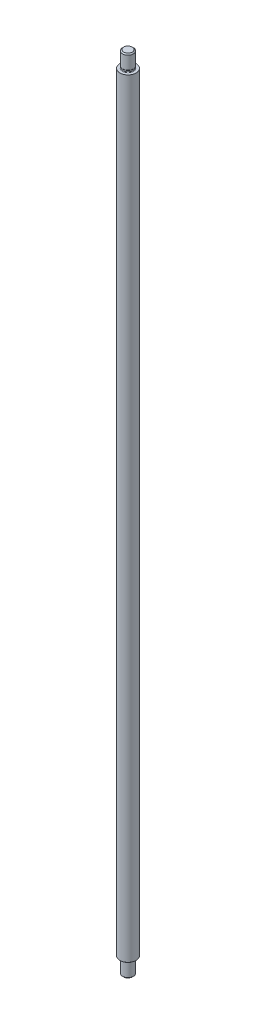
ISO-10303-21;
HEADER;
FILE_DESCRIPTION(('STEP AP214'),'2;1');
FILE_NAME('part.step','',(''),(''),'','','');
FILE_SCHEMA(('AUTOMOTIVE_DESIGN { 1 0 10303 214 1 1 1 1 }'));
ENDSEC;
DATA;
#1=APPLICATION_CONTEXT('core data for automotive mechanical design processes');
#2=APPLICATION_PROTOCOL_DEFINITION('international standard','automotive_design',2000,#1);
#3=PRODUCT_CONTEXT('',#1,'mechanical');
#4=PRODUCT('Part','Part','',(#3));
#5=PRODUCT_RELATED_PRODUCT_CATEGORY('part','',(#4));
#6=PRODUCT_DEFINITION_FORMATION('','',#4);
#7=PRODUCT_DEFINITION_CONTEXT('part definition',#1,'design');
#8=PRODUCT_DEFINITION('design','',#6,#7);
#9=PRODUCT_DEFINITION_SHAPE('','',#8);
#10=(LENGTH_UNIT() NAMED_UNIT(*) SI_UNIT(.MILLI.,.METRE.));
#11=(NAMED_UNIT(*) PLANE_ANGLE_UNIT() SI_UNIT($,.RADIAN.));
#12=(NAMED_UNIT(*) SI_UNIT($,.STERADIAN.) SOLID_ANGLE_UNIT());
#13=UNCERTAINTY_MEASURE_WITH_UNIT(LENGTH_MEASURE(1.E-05),#10,'distance_accuracy_value','');
#14=(GEOMETRIC_REPRESENTATION_CONTEXT(3) GLOBAL_UNCERTAINTY_ASSIGNED_CONTEXT((#13)) GLOBAL_UNIT_ASSIGNED_CONTEXT((#10,
#11,#12)) REPRESENTATION_CONTEXT('',''));
#15=CARTESIAN_POINT('',(0.,0.,0.));
#16=DIRECTION('',(0.,0.,1.));
#17=DIRECTION('',(1.,0.,0.));
#18=AXIS2_PLACEMENT_3D('',#15,#16,#17);
#19=CARTESIAN_POINT('',(-6.41454642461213E-11,-139.,0.));
#20=DIRECTION('',(0.,1.,0.));
#21=DIRECTION('',(0.,0.,1.));
#22=AXIS2_PLACEMENT_3D('',#19,#20,#21);
#23=CONICAL_SURFACE('',#22,5.00000000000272,0.785398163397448);
#24=CARTESIAN_POINT('',(-6.41454642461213E-11,-140.00000000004,0.));
#25=DIRECTION('',(0.,1.,0.));
#26=DIRECTION('',(0.,0.,1.));
#27=AXIS2_PLACEMENT_3D('',#24,#25,#26);
#28=CIRCLE('',#27,3.99999999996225);
#29=CARTESIAN_POINT('',(-6.41454642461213E-11,-140.00000000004,3.99999999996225));
#30=VERTEX_POINT('',#29);
#31=EDGE_CURVE('E83',#30,#30,#28,.T.);
#32=ORIENTED_EDGE('',*,*,#31,.T.);
#33=EDGE_LOOP('',(#32));
#34=FACE_BOUND('',#33,.T.);
#35=CARTESIAN_POINT('',(-6.41454642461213E-11,-139.,0.));
#36=DIRECTION('',(0.,1.,0.));
#37=DIRECTION('',(0.,0.,1.));
#38=AXIS2_PLACEMENT_3D('',#35,#36,#37);
#39=CIRCLE('',#38,5.00000000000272);
#40=CARTESIAN_POINT('',(-6.41454642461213E-11,-139.,5.00000000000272));
#41=VERTEX_POINT('',#40);
#42=EDGE_CURVE('E10',#41,#41,#39,.T.);
#43=ORIENTED_EDGE('',*,*,#42,.F.);
#44=EDGE_LOOP('',(#43));
#45=FACE_BOUND('',#44,.T.);
#46=ADVANCED_FACE('F31',(#34,#45),#23,.T.);
#47=CARTESIAN_POINT('',(-6.41454642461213E-11,-140.00000000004,0.));
#48=DIRECTION('',(0.,1.,0.));
#49=DIRECTION('',(0.,0.,1.));
#50=AXIS2_PLACEMENT_3D('',#47,#48,#49);
#51=CYLINDRICAL_SURFACE('',#50,5.00000000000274);
#52=ORIENTED_EDGE('',*,*,#42,.T.);
#53=EDGE_LOOP('',(#52));
#54=FACE_BOUND('',#53,.T.);
#55=CARTESIAN_POINT('',(-6.41454642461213E-11,-126.999999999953,0.));
#56=DIRECTION('',(0.,1.,0.));
#57=DIRECTION('',(0.,0.,1.));
#58=AXIS2_PLACEMENT_3D('',#55,#56,#57);
#59=CIRCLE('',#58,5.00000000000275);
#60=CARTESIAN_POINT('',(-6.41454642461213E-11,-126.999999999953,5.00000000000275));
#61=VERTEX_POINT('',#60);
#62=EDGE_CURVE('E37',#61,#61,#59,.T.);
#63=ORIENTED_EDGE('',*,*,#62,.F.);
#64=EDGE_LOOP('',(#63));
#65=FACE_BOUND('',#64,.T.);
#66=ADVANCED_FACE('F100',(#54,#65),#51,.T.);
#67=CARTESIAN_POINT('',(-6.41454642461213E-11,-126.687867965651,0.));
#68=DIRECTION('',(0.,-1.,0.));
#69=DIRECTION('',(0.,0.,-1.));
#70=AXIS2_PLACEMENT_3D('',#67,#68,#69);
#71=CONICAL_SURFACE('',#70,4.68786796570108,0.785398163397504);
#72=ORIENTED_EDGE('',*,*,#62,.T.);
#73=EDGE_LOOP('',(#72));
#74=FACE_BOUND('',#73,.T.);
#75=CARTESIAN_POINT('',(-6.41454642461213E-11,-126.687867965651,0.));
#76=DIRECTION('',(0.,1.,0.));
#77=DIRECTION('',(0.,0.,1.));
#78=AXIS2_PLACEMENT_3D('',#75,#76,#77);
#79=CIRCLE('',#78,4.68786796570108);
#80=CARTESIAN_POINT('',(-6.41454642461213E-11,-126.687867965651,4.68786796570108));
#81=VERTEX_POINT('',#80);
#82=EDGE_CURVE('E41',#81,#81,#79,.T.);
#83=ORIENTED_EDGE('',*,*,#82,.F.);
#84=EDGE_LOOP('',(#83));
#85=FACE_BOUND('',#84,.T.);
#86=ADVANCED_FACE('F104',(#74,#85),#71,.T.);
#87=CARTESIAN_POINT('',(-6.41457373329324E-11,-126.475735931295,0.));
#88=DIRECTION('',(0.,1.,0.));
#89=DIRECTION('',(0.,0.,1.));
#90=AXIS2_PLACEMENT_3D('',#87,#88,#89);
#91=TOROIDAL_SURFACE('',#90,4.90000000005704,0.300000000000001);
#92=ORIENTED_EDGE('',*,*,#82,.T.);
#93=EDGE_LOOP('',(#92));
#94=FACE_BOUND('',#93,.T.);
#95=CARTESIAN_POINT('',(-6.41454642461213E-11,-126.475735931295,0.));
#96=DIRECTION('',(0.,1.,0.));
#97=DIRECTION('',(0.,0.,1.));
#98=AXIS2_PLACEMENT_3D('',#95,#96,#97);
#99=CIRCLE('',#98,4.60000000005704);
#100=CARTESIAN_POINT('',(-6.41454642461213E-11,-126.475735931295,4.60000000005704));
#101=VERTEX_POINT('',#100);
#102=EDGE_CURVE('E45',#101,#101,#99,.T.);
#103=ORIENTED_EDGE('',*,*,#102,.F.);
#104=EDGE_LOOP('',(#103));
#105=FACE_BOUND('',#104,.T.);
#106=ADVANCED_FACE('F108',(#94,#105),#91,.F.);
#107=CARTESIAN_POINT('',(-6.41454642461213E-11,-140.00000000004,0.));
#108=DIRECTION('',(0.,1.,0.));
#109=DIRECTION('',(0.,0.,1.));
#110=AXIS2_PLACEMENT_3D('',#107,#108,#109);
#111=CYLINDRICAL_SURFACE('',#110,4.60000000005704);
#112=ORIENTED_EDGE('',*,*,#102,.T.);
#113=EDGE_LOOP('',(#112));
#114=FACE_BOUND('',#113,.T.);
#115=CARTESIAN_POINT('',(-6.41454642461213E-11,-125.500000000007,0.));
#116=DIRECTION('',(0.,1.,0.));
#117=DIRECTION('',(0.,0.,1.));
#118=AXIS2_PLACEMENT_3D('',#115,#116,#117);
#119=CIRCLE('',#118,4.60000000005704);
#120=CARTESIAN_POINT('',(-6.41454642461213E-11,-125.500000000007,4.60000000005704));
#121=VERTEX_POINT('',#120);
#122=EDGE_CURVE('E50',#121,#121,#119,.T.);
#123=ORIENTED_EDGE('',*,*,#122,.F.);
#124=EDGE_LOOP('',(#123));
#125=FACE_BOUND('',#124,.T.);
#126=ADVANCED_FACE('F114',(#114,#125),#111,.T.);
#127=CARTESIAN_POINT('',(-6.41457373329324E-11,-125.500000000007,0.));
#128=DIRECTION('',(0.,1.,0.));
#129=DIRECTION('',(0.,0.,1.));
#130=AXIS2_PLACEMENT_3D('',#127,#128,#129);
#131=TOROIDAL_SURFACE('',#130,5.10000000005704,0.500000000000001);
#132=ORIENTED_EDGE('',*,*,#122,.T.);
#133=EDGE_LOOP('',(#132));
#134=FACE_BOUND('',#133,.T.);
#135=CARTESIAN_POINT('',(-6.41454642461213E-11,-125.000000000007,0.));
#136=DIRECTION('',(0.,1.,0.));
#137=DIRECTION('',(0.,0.,1.));
#138=AXIS2_PLACEMENT_3D('',#135,#136,#137);
#139=CIRCLE('',#138,5.10000000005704);
#140=CARTESIAN_POINT('',(-6.41454642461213E-11,-125.000000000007,5.10000000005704));
#141=VERTEX_POINT('',#140);
#142=EDGE_CURVE('E53',#141,#141,#139,.T.);
#143=ORIENTED_EDGE('',*,*,#142,.F.);
#144=EDGE_LOOP('',(#143));
#145=FACE_BOUND('',#144,.T.);
#146=ADVANCED_FACE('F118',(#134,#145),#131,.F.);
#147=CARTESIAN_POINT('',(7.4999999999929,-125.000000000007,0.));
#148=DIRECTION('',(0.,-1.,0.));
#149=DIRECTION('',(0.,0.,-1.));
#150=AXIS2_PLACEMENT_3D('',#147,#148,#149);
#151=PLANE('',#150);
#152=ORIENTED_EDGE('',*,*,#142,.T.);
#153=EDGE_LOOP('',(#152));
#154=FACE_BOUND('',#153,.T.);
#155=CARTESIAN_POINT('',(-6.41454642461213E-11,-125.000000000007,0.));
#156=DIRECTION('',(0.,1.,0.));
#157=DIRECTION('',(0.,0.,1.));
#158=AXIS2_PLACEMENT_3D('',#155,#156,#157);
#159=CIRCLE('',#158,7.50000000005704);
#160=CARTESIAN_POINT('',(-6.41454642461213E-11,-125.000000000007,7.50000000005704));
#161=VERTEX_POINT('',#160);
#162=EDGE_CURVE('E56',#161,#161,#159,.T.);
#163=ORIENTED_EDGE('',*,*,#162,.F.);
#164=EDGE_LOOP('',(#163));
#165=FACE_BOUND('',#164,.T.);
#166=ADVANCED_FACE('F122',(#154,#165),#151,.T.);
#167=CARTESIAN_POINT('',(-6.41454642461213E-11,-140.00000000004,0.));
#168=DIRECTION('',(0.,1.,0.));
#169=DIRECTION('',(0.,0.,1.));
#170=AXIS2_PLACEMENT_3D('',#167,#168,#169);
#171=CYLINDRICAL_SURFACE('',#170,7.50000000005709);
#172=ORIENTED_EDGE('',*,*,#162,.T.);
#173=EDGE_LOOP('',(#172));
#174=FACE_BOUND('',#173,.T.);
#175=CARTESIAN_POINT('',(-6.41454642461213E-11,584.999999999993,0.));
#176=DIRECTION('',(0.,1.,0.));
#177=DIRECTION('',(0.,0.,1.));
#178=AXIS2_PLACEMENT_3D('',#175,#176,#177);
#179=CIRCLE('',#178,7.50000000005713);
#180=CARTESIAN_POINT('',(-6.41454642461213E-11,584.999999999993,7.50000000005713));
#181=VERTEX_POINT('',#180);
#182=EDGE_CURVE('E59',#181,#181,#179,.T.);
#183=ORIENTED_EDGE('',*,*,#182,.F.);
#184=EDGE_LOOP('',(#183));
#185=FACE_BOUND('',#184,.T.);
#186=ADVANCED_FACE('F126',(#174,#185),#171,.T.);
#187=CARTESIAN_POINT('',(5.09999999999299,584.999999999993,0.));
#188=DIRECTION('',(0.,1.,0.));
#189=DIRECTION('',(0.,0.,1.));
#190=AXIS2_PLACEMENT_3D('',#187,#188,#189);
#191=PLANE('',#190);
#192=ORIENTED_EDGE('',*,*,#182,.T.);
#193=EDGE_LOOP('',(#192));
#194=FACE_BOUND('',#193,.T.);
#195=CARTESIAN_POINT('',(-6.41454642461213E-11,584.999999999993,0.));
#196=DIRECTION('',(0.,1.,0.));
#197=DIRECTION('',(0.,0.,1.));
#198=AXIS2_PLACEMENT_3D('',#195,#196,#197);
#199=CIRCLE('',#198,5.10000000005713);
#200=CARTESIAN_POINT('',(-6.41454642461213E-11,584.999999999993,5.10000000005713));
#201=VERTEX_POINT('',#200);
#202=EDGE_CURVE('E62',#201,#201,#199,.T.);
#203=ORIENTED_EDGE('',*,*,#202,.F.);
#204=EDGE_LOOP('',(#203));
#205=FACE_BOUND('',#204,.T.);
#206=ADVANCED_FACE('F130',(#194,#205),#191,.T.);
#207=CARTESIAN_POINT('',(-6.41457373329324E-11,585.499999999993,0.));
#208=DIRECTION('',(0.,1.,0.));
#209=DIRECTION('',(0.,0.,1.));
#210=AXIS2_PLACEMENT_3D('',#207,#208,#209);
#211=TOROIDAL_SURFACE('',#210,5.10000000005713,0.500000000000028);
#212=ORIENTED_EDGE('',*,*,#202,.T.);
#213=EDGE_LOOP('',(#212));
#214=FACE_BOUND('',#213,.T.);
#215=CARTESIAN_POINT('',(-6.41454642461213E-11,585.499999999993,0.));
#216=DIRECTION('',(0.,1.,0.));
#217=DIRECTION('',(0.,0.,1.));
#218=AXIS2_PLACEMENT_3D('',#215,#216,#217);
#219=CIRCLE('',#218,4.60000000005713);
#220=CARTESIAN_POINT('',(-6.41454642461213E-11,585.499999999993,4.60000000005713));
#221=VERTEX_POINT('',#220);
#222=EDGE_CURVE('E65',#221,#221,#219,.T.);
#223=ORIENTED_EDGE('',*,*,#222,.F.);
#224=EDGE_LOOP('',(#223));
#225=FACE_BOUND('',#224,.T.);
#226=ADVANCED_FACE('F134',(#214,#225),#211,.F.);
#227=CARTESIAN_POINT('',(-6.41454642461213E-11,-140.00000000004,0.));
#228=DIRECTION('',(0.,1.,0.));
#229=DIRECTION('',(0.,0.,1.));
#230=AXIS2_PLACEMENT_3D('',#227,#228,#229);
#231=CYLINDRICAL_SURFACE('',#230,4.60000000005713);
#232=ORIENTED_EDGE('',*,*,#222,.T.);
#233=EDGE_LOOP('',(#232));
#234=FACE_BOUND('',#233,.T.);
#235=CARTESIAN_POINT('',(-6.41454642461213E-11,586.475735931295,0.));
#236=DIRECTION('',(0.,1.,0.));
#237=DIRECTION('',(0.,0.,1.));
#238=AXIS2_PLACEMENT_3D('',#235,#236,#237);
#239=CIRCLE('',#238,4.60000000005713);
#240=CARTESIAN_POINT('',(-6.41454642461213E-11,586.475735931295,4.60000000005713));
#241=VERTEX_POINT('',#240);
#242=EDGE_CURVE('E68',#241,#241,#239,.T.);
#243=ORIENTED_EDGE('',*,*,#242,.F.);
#244=EDGE_LOOP('',(#243));
#245=FACE_BOUND('',#244,.T.);
#246=ADVANCED_FACE('F138',(#234,#245),#231,.T.);
#247=CARTESIAN_POINT('',(-6.41457373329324E-11,586.475735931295,0.));
#248=DIRECTION('',(0.,1.,0.));
#249=DIRECTION('',(0.,0.,1.));
#250=AXIS2_PLACEMENT_3D('',#247,#248,#249);
#251=TOROIDAL_SURFACE('',#250,4.90000000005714,0.300000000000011);
#252=ORIENTED_EDGE('',*,*,#242,.T.);
#253=EDGE_LOOP('',(#252));
#254=FACE_BOUND('',#253,.T.);
#255=CARTESIAN_POINT('',(-6.41454642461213E-11,586.687867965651,0.));
#256=DIRECTION('',(0.,1.,0.));
#257=DIRECTION('',(0.,0.,1.));
#258=AXIS2_PLACEMENT_3D('',#255,#256,#257);
#259=CIRCLE('',#258,4.68786796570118);
#260=CARTESIAN_POINT('',(-6.41454642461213E-11,586.687867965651,4.68786796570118));
#261=VERTEX_POINT('',#260);
#262=EDGE_CURVE('E71',#261,#261,#259,.T.);
#263=ORIENTED_EDGE('',*,*,#262,.F.);
#264=EDGE_LOOP('',(#263));
#265=FACE_BOUND('',#264,.T.);
#266=ADVANCED_FACE('F142',(#254,#265),#251,.F.);
#267=CARTESIAN_POINT('',(-6.41454642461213E-11,586.999999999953,0.));
#268=DIRECTION('',(0.,1.,0.));
#269=DIRECTION('',(0.,0.,1.));
#270=AXIS2_PLACEMENT_3D('',#267,#268,#269);
#271=CONICAL_SURFACE('',#270,5.0000000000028,0.785398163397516);
#272=ORIENTED_EDGE('',*,*,#262,.T.);
#273=EDGE_LOOP('',(#272));
#274=FACE_BOUND('',#273,.T.);
#275=CARTESIAN_POINT('',(-6.41454642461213E-11,586.999999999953,0.));
#276=DIRECTION('',(0.,1.,0.));
#277=DIRECTION('',(0.,0.,1.));
#278=AXIS2_PLACEMENT_3D('',#275,#276,#277);
#279=CIRCLE('',#278,5.0000000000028);
#280=CARTESIAN_POINT('',(-6.41454642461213E-11,586.999999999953,5.0000000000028));
#281=VERTEX_POINT('',#280);
#282=EDGE_CURVE('E74',#281,#281,#279,.T.);
#283=ORIENTED_EDGE('',*,*,#282,.F.);
#284=EDGE_LOOP('',(#283));
#285=FACE_BOUND('',#284,.T.);
#286=ADVANCED_FACE('F146',(#274,#285),#271,.T.);
#287=CARTESIAN_POINT('',(-6.41454642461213E-11,-140.00000000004,0.));
#288=DIRECTION('',(0.,1.,0.));
#289=DIRECTION('',(0.,0.,1.));
#290=AXIS2_PLACEMENT_3D('',#287,#288,#289);
#291=CYLINDRICAL_SURFACE('',#290,5.0000000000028);
#292=ORIENTED_EDGE('',*,*,#282,.T.);
#293=EDGE_LOOP('',(#292));
#294=FACE_BOUND('',#293,.T.);
#295=CARTESIAN_POINT('',(-6.41454642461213E-11,599.,0.));
#296=DIRECTION('',(0.,1.,0.));
#297=DIRECTION('',(0.,0.,1.));
#298=AXIS2_PLACEMENT_3D('',#295,#296,#297);
#299=CIRCLE('',#298,5.0000000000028);
#300=CARTESIAN_POINT('',(-6.41454642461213E-11,599.,5.0000000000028));
#301=VERTEX_POINT('',#300);
#302=EDGE_CURVE('E77',#301,#301,#299,.T.);
#303=ORIENTED_EDGE('',*,*,#302,.F.);
#304=EDGE_LOOP('',(#303));
#305=FACE_BOUND('',#304,.T.);
#306=ADVANCED_FACE('F150',(#294,#305),#291,.T.);
#307=CARTESIAN_POINT('',(-6.41454642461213E-11,600.00000000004,0.));
#308=DIRECTION('',(0.,-1.,0.));
#309=DIRECTION('',(0.,0.,-1.));
#310=AXIS2_PLACEMENT_3D('',#307,#308,#309);
#311=CONICAL_SURFACE('',#310,3.99999999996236,0.785398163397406);
#312=ORIENTED_EDGE('',*,*,#302,.T.);
#313=EDGE_LOOP('',(#312));
#314=FACE_BOUND('',#313,.T.);
#315=CARTESIAN_POINT('',(-6.41454642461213E-11,600.00000000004,0.));
#316=DIRECTION('',(0.,1.,0.));
#317=DIRECTION('',(0.,0.,1.));
#318=AXIS2_PLACEMENT_3D('',#315,#316,#317);
#319=CIRCLE('',#318,3.99999999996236);
#320=CARTESIAN_POINT('',(-6.41454642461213E-11,600.00000000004,3.99999999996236));
#321=VERTEX_POINT('',#320);
#322=EDGE_CURVE('E80',#321,#321,#319,.T.);
#323=ORIENTED_EDGE('',*,*,#322,.F.);
#324=EDGE_LOOP('',(#323));
#325=FACE_BOUND('',#324,.T.);
#326=ADVANCED_FACE('F96',(#314,#325),#311,.T.);
#327=CARTESIAN_POINT('',(-6.41454642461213E-11,600.00000000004,0.));
#328=DIRECTION('',(0.,1.,0.));
#329=DIRECTION('',(0.,0.,1.));
#330=AXIS2_PLACEMENT_3D('',#327,#328,#329);
#331=PLANE('',#330);
#332=ORIENTED_EDGE('',*,*,#322,.T.);
#333=EDGE_LOOP('',(#332));
#334=FACE_BOUND('',#333,.T.);
#335=ADVANCED_FACE('F91',(#334),#331,.T.);
#336=CARTESIAN_POINT('',(3.99999999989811,-140.00000000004,0.));
#337=DIRECTION('',(0.,-1.,0.));
#338=DIRECTION('',(0.,0.,-1.));
#339=AXIS2_PLACEMENT_3D('',#336,#337,#338);
#340=PLANE('',#339);
#341=ORIENTED_EDGE('',*,*,#31,.F.);
#342=EDGE_LOOP('',(#341));
#343=FACE_BOUND('',#342,.T.);
#344=ADVANCED_FACE('F89',(#343),#340,.T.);
#345=CLOSED_SHELL('',(#46,#66,#86,#106,#126,#146,#166,#186,#206,#226,#246,#266,#286,#306,#326,
#335,#344));
#346=MANIFOLD_SOLID_BREP('B2',#345);
#347=ADVANCED_BREP_SHAPE_REPRESENTATION('',(#18,#346),#14);
#348=SHAPE_DEFINITION_REPRESENTATION(#9,#347);
ENDSEC;
END-ISO-10303-21;
